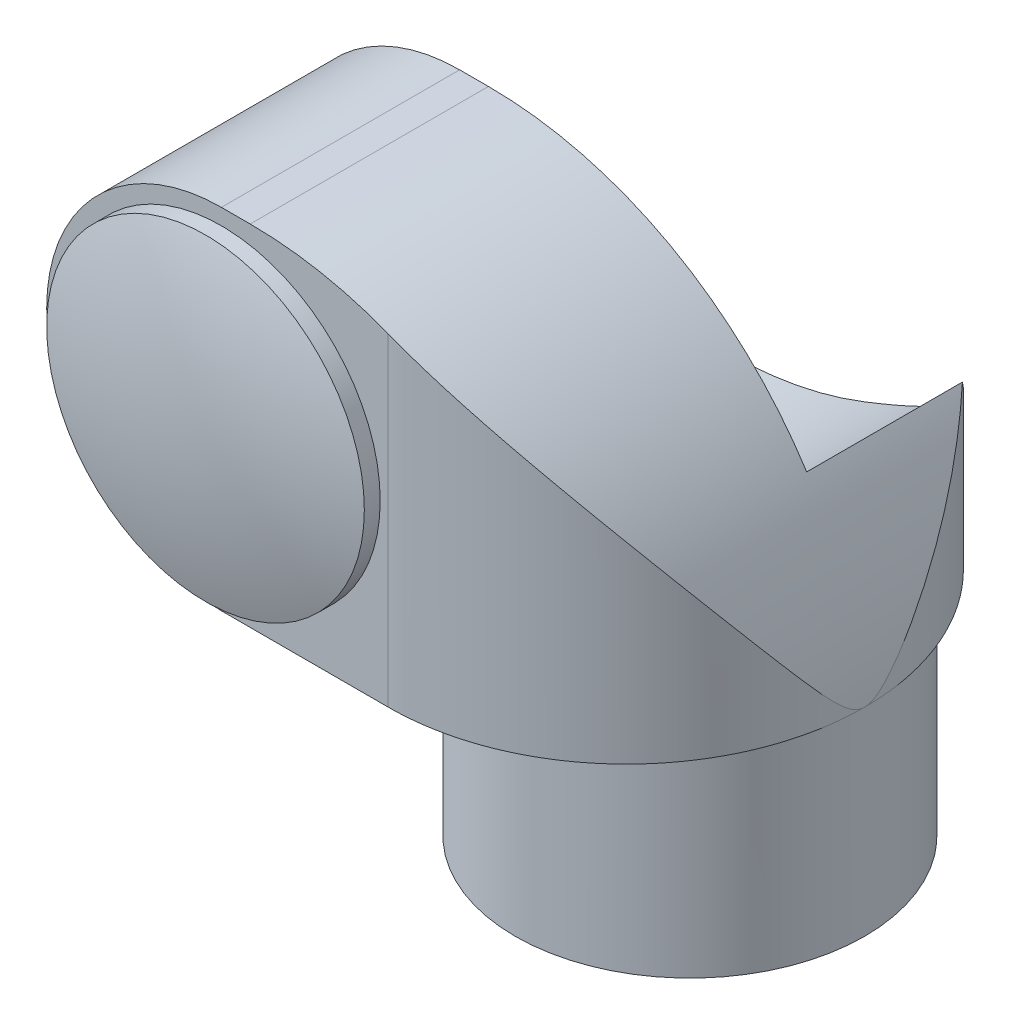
ISO-10303-21;
HEADER;
FILE_DESCRIPTION(('STEP AP214'),'2;1');
FILE_NAME('part.step','',(''),(''),'','','');
FILE_SCHEMA(('AUTOMOTIVE_DESIGN { 1 0 10303 214 1 1 1 1 }'));
ENDSEC;
DATA;
#1=APPLICATION_CONTEXT('core data for automotive mechanical design processes');
#2=APPLICATION_PROTOCOL_DEFINITION('international standard','automotive_design',2000,#1);
#3=PRODUCT_CONTEXT('',#1,'mechanical');
#4=PRODUCT('Part','Part','',(#3));
#5=PRODUCT_RELATED_PRODUCT_CATEGORY('part','',(#4));
#6=PRODUCT_DEFINITION_FORMATION('','',#4);
#7=PRODUCT_DEFINITION_CONTEXT('part definition',#1,'design');
#8=PRODUCT_DEFINITION('design','',#6,#7);
#9=PRODUCT_DEFINITION_SHAPE('','',#8);
#10=(LENGTH_UNIT() NAMED_UNIT(*) SI_UNIT(.MILLI.,.METRE.));
#11=(NAMED_UNIT(*) PLANE_ANGLE_UNIT() SI_UNIT($,.RADIAN.));
#12=(NAMED_UNIT(*) SI_UNIT($,.STERADIAN.) SOLID_ANGLE_UNIT());
#13=UNCERTAINTY_MEASURE_WITH_UNIT(LENGTH_MEASURE(1.E-05),#10,'distance_accuracy_value','');
#14=(GEOMETRIC_REPRESENTATION_CONTEXT(3) GLOBAL_UNCERTAINTY_ASSIGNED_CONTEXT((#13)) GLOBAL_UNIT_ASSIGNED_CONTEXT((#10,
#11,#12)) REPRESENTATION_CONTEXT('',''));
#15=CARTESIAN_POINT('',(0.,0.,0.));
#16=DIRECTION('',(0.,0.,1.));
#17=DIRECTION('',(1.,0.,0.));
#18=AXIS2_PLACEMENT_3D('',#15,#16,#17);
#19=CARTESIAN_POINT('',(-29.,0.,30.));
#20=DIRECTION('',(0.,0.,1.));
#21=DIRECTION('',(1.,0.,0.));
#22=AXIS2_PLACEMENT_3D('',#19,#20,#21);
#23=PLANE('',#22);
#24=DIRECTION('',(0.,1.,0.));
#25=VECTOR('',#24,1.);
#26=CARTESIAN_POINT('',(-8.,-22.,30.));
#27=LINE('',#26,#25);
#28=CARTESIAN_POINT('',(-8.,-22.,30.));
#29=VERTEX_POINT('',#28);
#30=CARTESIAN_POINT('',(-7.99999999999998,18.7097571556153,30.));
#31=VERTEX_POINT('',#30);
#32=EDGE_CURVE('E175',#29,#31,#27,.T.);
#33=ORIENTED_EDGE('',*,*,#32,.T.);
#34=CARTESIAN_POINT('',(-25.370877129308,-25.5,30.));
#35=DIRECTION('',(0.,0.,1.));
#36=DIRECTION('',(-1.,0.,0.));
#37=AXIS2_PLACEMENT_3D('',#34,#35,#36);
#38=CIRCLE('',#37,47.5);
#39=CARTESIAN_POINT('',(-25.370877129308,22.,30.));
#40=VERTEX_POINT('',#39);
#41=EDGE_CURVE('E191',#31,#40,#38,.T.);
#42=ORIENTED_EDGE('',*,*,#41,.T.);
#43=DIRECTION('',(-1.,0.,0.));
#44=VECTOR('',#43,1.);
#45=CARTESIAN_POINT('',(-29.,22.,30.));
#46=LINE('',#45,#44);
#47=CARTESIAN_POINT('',(-29.,22.,30.));
#48=VERTEX_POINT('',#47);
#49=EDGE_CURVE('E118',#40,#48,#46,.T.);
#50=ORIENTED_EDGE('',*,*,#49,.T.);
#51=CARTESIAN_POINT('',(-29.,0.,30.));
#52=DIRECTION('',(0.,0.,1.));
#53=DIRECTION('',(1.,0.,0.));
#54=AXIS2_PLACEMENT_3D('',#51,#52,#53);
#55=CIRCLE('',#54,22.);
#56=CARTESIAN_POINT('',(-29.,-22.,30.));
#57=VERTEX_POINT('',#56);
#58=EDGE_CURVE('E185',#48,#57,#55,.T.);
#59=ORIENTED_EDGE('',*,*,#58,.T.);
#60=DIRECTION('',(1.,0.,0.));
#61=VECTOR('',#60,1.);
#62=CARTESIAN_POINT('',(-29.,-22.,30.));
#63=LINE('',#62,#61);
#64=EDGE_CURVE('E188',#57,#29,#63,.T.);
#65=ORIENTED_EDGE('',*,*,#64,.T.);
#66=EDGE_LOOP('',(#33,#42,#50,#59,#65));
#67=FACE_BOUND('',#66,.T.);
#68=CARTESIAN_POINT('',(-29.,0.,30.));
#69=DIRECTION('',(0.,0.,1.));
#70=DIRECTION('',(1.,0.,0.));
#71=AXIS2_PLACEMENT_3D('',#68,#69,#70);
#72=CIRCLE('',#71,20.);
#73=CARTESIAN_POINT('',(-8.99999999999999,0.,30.));
#74=VERTEX_POINT('',#73);
#75=EDGE_CURVE('E218',#74,#74,#72,.T.);
#76=ORIENTED_EDGE('',*,*,#75,.F.);
#77=EDGE_LOOP('',(#76));
#78=FACE_BOUND('',#77,.T.);
#79=ADVANCED_FACE('F32',(#67,#78),#23,.T.);
#80=CARTESIAN_POINT('',(-29.,-22.,30.));
#81=DIRECTION('',(0.,1.,0.));
#82=DIRECTION('',(-1.,0.,0.));
#83=AXIS2_PLACEMENT_3D('',#80,#81,#82);
#84=PLANE('',#83);
#85=DIRECTION('',(0.,0.,1.));
#86=VECTOR('',#85,1.);
#87=CARTESIAN_POINT('',(-25.370877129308,-22.,-30.));
#88=LINE('',#87,#86);
#89=CARTESIAN_POINT('',(-25.370877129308,-22.,-30.));
#90=VERTEX_POINT('',#89);
#91=CARTESIAN_POINT('',(-25.370877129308,-22.,0.));
#92=VERTEX_POINT('',#91);
#93=EDGE_CURVE('E209',#90,#92,#88,.T.);
#94=ORIENTED_EDGE('',*,*,#93,.F.);
#95=DIRECTION('',(1.,0.,0.));
#96=VECTOR('',#95,1.);
#97=CARTESIAN_POINT('',(-29.,-22.,-30.));
#98=LINE('',#97,#96);
#99=CARTESIAN_POINT('',(-7.99999999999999,-22.,-30.));
#100=VERTEX_POINT('',#99);
#101=EDGE_CURVE('E55',#90,#100,#98,.T.);
#102=ORIENTED_EDGE('',*,*,#101,.T.);
#103=CARTESIAN_POINT('',(-8.,-22.,0.));
#104=DIRECTION('',(0.,-1.,0.));
#105=DIRECTION('',(1.,0.,0.));
#106=AXIS2_PLACEMENT_3D('',#103,#104,#105);
#107=CIRCLE('',#106,30.);
#108=CARTESIAN_POINT('',(22.,-22.,0.));
#109=VERTEX_POINT('',#108);
#110=EDGE_CURVE('E200',#100,#109,#107,.T.);
#111=ORIENTED_EDGE('',*,*,#110,.T.);
#112=CARTESIAN_POINT('',(0.,-22.,0.));
#113=DIRECTION('',(0.,1.,0.));
#114=DIRECTION('',(0.,0.,1.));
#115=AXIS2_PLACEMENT_3D('',#112,#113,#114);
#116=CIRCLE('',#115,22.);
#117=EDGE_CURVE('E181',#109,#109,#116,.T.);
#118=ORIENTED_EDGE('',*,*,#117,.T.);
#119=EDGE_CURVE('E198',#109,#29,#107,.T.);
#120=ORIENTED_EDGE('',*,*,#119,.T.);
#121=ORIENTED_EDGE('',*,*,#64,.F.);
#122=DIRECTION('',(0.,0.,-1.));
#123=VECTOR('',#122,1.);
#124=CARTESIAN_POINT('',(-29.,-22.,30.));
#125=LINE('',#124,#123);
#126=CARTESIAN_POINT('',(-29.,-22.,0.));
#127=VERTEX_POINT('',#126);
#128=EDGE_CURVE('E41',#57,#127,#125,.T.);
#129=ORIENTED_EDGE('',*,*,#128,.T.);
#130=DIRECTION('',(1.,0.,0.));
#131=VECTOR('',#130,1.);
#132=CARTESIAN_POINT('',(-29.,-22.,0.));
#133=LINE('',#132,#131);
#134=EDGE_CURVE('E196',#127,#92,#133,.T.);
#135=ORIENTED_EDGE('',*,*,#134,.T.);
#136=EDGE_LOOP('',(#94,#102,#111,#118,#120,#121,#129,#135));
#137=FACE_BOUND('',#136,.T.);
#138=ADVANCED_FACE('F149',(#137),#84,.F.);
#139=CARTESIAN_POINT('',(-29.,0.,30.));
#140=DIRECTION('',(0.,0.,-1.));
#141=DIRECTION('',(-1.,0.,0.));
#142=AXIS2_PLACEMENT_3D('',#139,#140,#141);
#143=CYLINDRICAL_SURFACE('',#142,22.);
#144=DIRECTION('',(0.,0.,-1.));
#145=VECTOR('',#144,1.);
#146=CARTESIAN_POINT('',(-29.,22.,30.));
#147=LINE('',#146,#145);
#148=CARTESIAN_POINT('',(-29.,22.,0.));
#149=VERTEX_POINT('',#148);
#150=EDGE_CURVE('E119',#48,#149,#147,.T.);
#151=ORIENTED_EDGE('',*,*,#150,.T.);
#152=CARTESIAN_POINT('',(-29.,0.,0.));
#153=DIRECTION('',(0.,0.,1.));
#154=DIRECTION('',(1.,0.,0.));
#155=AXIS2_PLACEMENT_3D('',#152,#153,#154);
#156=CIRCLE('',#155,22.);
#157=EDGE_CURVE('E101',#149,#127,#156,.T.);
#158=ORIENTED_EDGE('',*,*,#157,.T.);
#159=ORIENTED_EDGE('',*,*,#128,.F.);
#160=ORIENTED_EDGE('',*,*,#58,.F.);
#161=EDGE_LOOP('',(#151,#158,#159,#160));
#162=FACE_BOUND('',#161,.T.);
#163=ADVANCED_FACE('F155',(#162),#143,.T.);
#164=CARTESIAN_POINT('',(-25.370877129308,-25.5,30.));
#165=DIRECTION('',(0.,0.,-1.));
#166=DIRECTION('',(-1.,0.,0.));
#167=AXIS2_PLACEMENT_3D('',#164,#165,#166);
#168=CYLINDRICAL_SURFACE('',#167,47.5);
#169=CARTESIAN_POINT('',(-7.99999999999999,18.7097571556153,30.));
#170=CARTESIAN_POINT('',(-7.56651433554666,18.5394487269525,30.0000097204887));
#171=CARTESIAN_POINT('',(-7.1355781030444,18.362749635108,29.990605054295));
#172=CARTESIAN_POINT('',(-6.27980889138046,17.9970941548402,29.9537005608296));
#173=CARTESIAN_POINT('',(-5.85497483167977,17.8081399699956,29.9262039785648));
#174=CARTESIAN_POINT('',(-5.01290872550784,17.4187377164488,29.8539045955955));
#175=CARTESIAN_POINT('',(-4.59566595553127,17.2183078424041,29.8091285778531));
#176=CARTESIAN_POINT('',(-3.76890543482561,16.8062437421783,29.7030569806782));
#177=CARTESIAN_POINT('',(-3.35938802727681,16.5946090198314,29.6417606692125));
#178=CARTESIAN_POINT('',(-2.15202468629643,15.9483015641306,29.4357404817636));
#179=CARTESIAN_POINT('',(-1.36627834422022,15.4980098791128,29.268070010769));
#180=CARTESIAN_POINT('',(0.168412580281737,14.5600132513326,28.8774098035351));
#181=CARTESIAN_POINT('',(0.917338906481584,14.0722900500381,28.6543929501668));
#182=CARTESIAN_POINT('',(2.5531621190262,12.9410274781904,28.0988857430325));
#183=CARTESIAN_POINT('',(3.42927347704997,12.2884563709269,27.7529618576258));
#184=CARTESIAN_POINT('',(5.11749358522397,10.9400505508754,26.9960676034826));
#185=CARTESIAN_POINT('',(5.92959315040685,10.2442096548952,26.5850879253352));
#186=CARTESIAN_POINT('',(7.49285473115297,8.81259008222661,25.705633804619));
#187=CARTESIAN_POINT('',(8.24369978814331,8.07663296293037,25.2368883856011));
#188=CARTESIAN_POINT('',(9.68040760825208,6.57395304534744,24.2520491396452));
#189=CARTESIAN_POINT('',(10.3662666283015,5.80722847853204,23.7359525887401));
#190=CARTESIAN_POINT('',(11.9300216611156,3.94309939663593,22.453913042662));
#191=CARTESIAN_POINT('',(12.7782202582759,2.83356125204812,21.6691497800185));
#192=CARTESIAN_POINT('',(13.9610019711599,1.14071491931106,20.4459341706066));
#193=CARTESIAN_POINT('',(14.3404573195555,0.571477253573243,20.0303675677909));
#194=CARTESIAN_POINT('',(15.0701504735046,-0.575410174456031,19.1854034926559));
#195=CARTESIAN_POINT('',(15.420388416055,-1.15305989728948,18.7560060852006));
#196=CARTESIAN_POINT('',(16.4271284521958,-2.89526047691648,17.4505721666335));
#197=CARTESIAN_POINT('',(17.0409444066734,-4.0709185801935,16.5559483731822));
#198=CARTESIAN_POINT('',(17.8788126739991,-5.84946117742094,15.1846539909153));
#199=CARTESIAN_POINT('',(18.1442648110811,-6.44474259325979,14.722722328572));
#200=CARTESIAN_POINT('',(18.6481619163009,-7.63958107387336,13.7897254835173));
#201=CARTESIAN_POINT('',(18.8866076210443,-8.23913802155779,13.3186605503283));
#202=CARTESIAN_POINT('',(19.4348396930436,-9.70297471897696,12.1613875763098));
#203=CARTESIAN_POINT('',(19.7305689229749,-10.5690135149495,11.4706872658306));
#204=CARTESIAN_POINT('',(20.1339114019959,-11.8702367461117,10.4222411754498));
#205=CARTESIAN_POINT('',(20.2616448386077,-12.3043164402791,10.070711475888));
#206=CARTESIAN_POINT('',(20.5038360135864,-13.1726366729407,9.36328408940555));
#207=CARTESIAN_POINT('',(20.6182936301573,-13.606877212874,9.00738636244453));
#208=CARTESIAN_POINT('',(20.8756491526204,-14.642172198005,8.15267084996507));
#209=CARTESIAN_POINT('',(21.0124862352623,-15.2429587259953,7.65168036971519));
#210=CARTESIAN_POINT('',(21.1987780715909,-16.1399604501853,6.89195452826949));
#211=CARTESIAN_POINT('',(21.2576644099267,-16.4379635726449,6.63760221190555));
#212=CARTESIAN_POINT('',(21.3691969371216,-17.0320158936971,6.12527867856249));
#213=CARTESIAN_POINT('',(21.4218433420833,-17.3280651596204,5.86730758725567));
#214=CARTESIAN_POINT('',(21.5346196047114,-17.9986796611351,5.27454582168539));
#215=CARTESIAN_POINT('',(21.5927807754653,-18.3722699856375,4.93827638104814));
#216=CARTESIAN_POINT('',(21.6992110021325,-19.1127530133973,4.25192076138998));
#217=CARTESIAN_POINT('',(21.747413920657,-19.4795870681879,3.90175953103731));
#218=CARTESIAN_POINT('',(21.8119658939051,-20.0170583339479,3.35860630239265));
#219=CARTESIAN_POINT('',(21.832286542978,-20.1950858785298,3.17343622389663));
#220=CARTESIAN_POINT('',(21.8701342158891,-20.5434422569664,2.794893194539));
#221=CARTESIAN_POINT('',(21.8876555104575,-20.7137548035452,2.60150442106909));
#222=CARTESIAN_POINT('',(21.9194864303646,-21.0392872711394,2.20534221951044));
#223=CARTESIAN_POINT('',(21.9338268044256,-21.1946426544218,2.00268376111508));
#224=CARTESIAN_POINT('',(21.9590429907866,-21.4814199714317,1.5811895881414));
#225=CARTESIAN_POINT('',(21.9699344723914,-21.6129489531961,1.36243277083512));
#226=CARTESIAN_POINT('',(21.9837749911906,-21.7863358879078,0.995881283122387));
#227=CARTESIAN_POINT('',(21.9881533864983,-21.8429202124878,0.85533096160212));
#228=CARTESIAN_POINT('',(21.9949833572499,-21.9324673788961,0.567099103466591));
#229=CARTESIAN_POINT('',(21.9974427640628,-21.9655261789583,0.419449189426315));
#230=CARTESIAN_POINT('',(22.0001466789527,-22.0019239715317,0.118381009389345));
#231=CARTESIAN_POINT('',(22.0003631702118,-22.0048870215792,-0.0350862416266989));
#232=CARTESIAN_POINT('',(21.9984675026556,-21.9793046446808,-0.339504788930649));
#233=CARTESIAN_POINT('',(21.9963500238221,-21.9506872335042,-0.490449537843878));
#234=CARTESIAN_POINT('',(21.9893426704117,-21.8582881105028,-0.820270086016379));
#235=CARTESIAN_POINT('',(21.9839083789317,-21.787703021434,-0.997129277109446));
#236=CARTESIAN_POINT('',(21.9706034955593,-21.6216987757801,-1.33878747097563));
#237=CARTESIAN_POINT('',(21.9627231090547,-21.5261800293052,-1.50353463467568));
#238=CARTESIAN_POINT('',(21.9384457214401,-21.2444524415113,-1.9409122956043));
#239=CARTESIAN_POINT('',(21.9200528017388,-21.0432950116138,-2.20354789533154));
#240=CARTESIAN_POINT('',(21.8782979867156,-20.6202954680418,-2.7114537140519));
#241=CARTESIAN_POINT('',(21.8549210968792,-20.3983920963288,-2.95666848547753));
#242=CARTESIAN_POINT('',(21.8034022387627,-19.942088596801,-3.43742704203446));
#243=CARTESIAN_POINT('',(21.7752327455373,-19.7076219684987,-3.67290460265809));
#244=CARTESIAN_POINT('',(21.7144260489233,-19.2324943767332,-4.13609641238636));
#245=CARTESIAN_POINT('',(21.681795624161,-18.9918432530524,-4.36382179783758));
#246=CARTESIAN_POINT('',(21.6124179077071,-18.5086468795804,-4.81202947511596));
#247=CARTESIAN_POINT('',(21.5757114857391,-18.2661397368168,-5.03255927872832));
#248=CARTESIAN_POINT('',(21.4979657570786,-17.7784327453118,-5.46985268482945));
#249=CARTESIAN_POINT('',(21.4569262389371,-17.5332327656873,-5.68661610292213));
#250=CARTESIAN_POINT('',(21.327307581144,-16.7948813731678,-6.33263325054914));
#251=CARTESIAN_POINT('',(21.23223937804,-16.2990559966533,-6.75754322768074));
#252=CARTESIAN_POINT('',(21.0246500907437,-15.3037208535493,-7.59985308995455));
#253=CARTESIAN_POINT('',(20.912108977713,-14.8042074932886,-8.01724373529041));
#254=CARTESIAN_POINT('',(20.6695491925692,-13.8041083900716,-8.84551530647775));
#255=CARTESIAN_POINT('',(20.5395321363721,-13.3035227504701,-9.25639683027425));
#256=CARTESIAN_POINT('',(20.2622292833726,-12.3038653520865,-10.0713009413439));
#257=CARTESIAN_POINT('',(20.1149904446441,-11.8047931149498,-10.475338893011));
#258=CARTESIAN_POINT('',(19.8027933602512,-10.8077420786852,-11.2778552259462));
#259=CARTESIAN_POINT('',(19.6378348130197,-10.3097632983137,-11.6763335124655));
#260=CARTESIAN_POINT('',(19.1161909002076,-8.81890038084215,-12.8630936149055));
#261=CARTESIAN_POINT('',(18.7326056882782,-7.82861250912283,-13.6430884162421));
#262=CARTESIAN_POINT('',(18.0501654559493,-6.23063019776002,-14.8891363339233));
#263=CARTESIAN_POINT('',(17.7737582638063,-5.61921982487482,-15.3628563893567));
#264=CARTESIAN_POINT('',(17.1918194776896,-4.40208764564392,-16.2995801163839));
#265=CARTESIAN_POINT('',(16.8862869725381,-3.79636601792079,-16.7625834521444));
#266=CARTESIAN_POINT('',(15.9248222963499,-1.98875820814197,-18.1342348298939));
#267=CARTESIAN_POINT('',(15.22413502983,-0.796693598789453,-19.025317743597));
#268=CARTESIAN_POINT('',(14.080666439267,0.963467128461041,-20.3168513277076));
#269=CARTESIAN_POINT('',(13.6841269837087,1.54550179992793,-20.7398265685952));
#270=CARTESIAN_POINT('',(12.8595257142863,2.69909858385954,-21.569009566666));
#271=CARTESIAN_POINT('',(12.4314626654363,3.27066028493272,-21.9752166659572));
#272=CARTESIAN_POINT('',(11.0995658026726,4.9667297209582,-23.1651360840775));
#273=CARTESIAN_POINT('',(10.1472862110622,6.07376735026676,-23.9209907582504));
#274=CARTESIAN_POINT('',(8.51158018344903,7.80220969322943,-25.0586057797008));
#275=CARTESIAN_POINT('',(7.8696604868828,8.44341721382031,-25.4706040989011));
#276=CARTESIAN_POINT('',(6.53680472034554,9.69925774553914,-26.2541179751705));
#277=CARTESIAN_POINT('',(5.84587424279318,10.3138937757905,-26.6256381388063));
#278=CARTESIAN_POINT('',(4.41787795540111,11.5100596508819,-27.3207734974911));
#279=CARTESIAN_POINT('',(3.68098884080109,12.0917016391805,-27.6445577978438));
#280=CARTESIAN_POINT('',(2.15994560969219,13.2194989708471,-28.2390138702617));
#281=CARTESIAN_POINT('',(1.37579569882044,13.7656574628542,-28.509690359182));
#282=CARTESIAN_POINT('',(-0.0893003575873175,14.7207704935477,-28.9463868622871));
#283=CARTESIAN_POINT('',(-0.762822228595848,15.1365259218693,-29.1224958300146));
#284=CARTESIAN_POINT('',(-2.13742470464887,15.9377707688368,-29.4300145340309));
#285=CARTESIAN_POINT('',(-2.83849538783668,16.3232709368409,-29.561440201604));
#286=CARTESIAN_POINT('',(-3.91114854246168,16.8779901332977,-29.7222730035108));
#287=CARTESIAN_POINT('',(-4.27368781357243,17.0596477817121,-29.7699489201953));
#288=CARTESIAN_POINT('',(-5.00450980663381,17.4141696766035,-29.8523403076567));
#289=CARTESIAN_POINT('',(-5.37279235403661,17.5870341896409,-29.887056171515));
#290=CARTESIAN_POINT('',(-6.11493402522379,17.9237818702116,-29.9430314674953));
#291=CARTESIAN_POINT('',(-6.48879872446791,18.0876551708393,-29.964276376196));
#292=CARTESIAN_POINT('',(-7.24112326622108,18.4059118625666,-29.9927644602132));
#293=CARTESIAN_POINT('',(-7.61958365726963,18.5602941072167,-30.0000059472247));
#294=CARTESIAN_POINT('',(-7.99999999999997,18.7097571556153,-30.));
#295=B_SPLINE_CURVE_WITH_KNOTS('',3,(#169,#170,#171,#172,#173,#174,#175,#176,#177,#178,#179,
#180,#181,#182,#183,#184,#185,#186,#187,#188,#189,#190,#191,#192,#193,#194,#195,#196,#197,#198,
#199,#200,#201,#202,#203,#204,#205,#206,#207,#208,#209,#210,#211,#212,#213,#214,#215,#216,#217,
#218,#219,#220,#221,#222,#223,#224,#225,#226,#227,#228,#229,#230,#231,#232,#233,#234,#235,#236,
#237,#238,#239,#240,#241,#242,#243,#244,#245,#246,#247,#248,#249,#250,#251,#252,#253,#254,#255,
#256,#257,#258,#259,#260,#261,#262,#263,#264,#265,#266,#267,#268,#269,#270,#271,#272,#273,#274,
#275,#276,#277,#278,#279,#280,#281,#282,#283,#284,#285,#286,#287,#288,#289,#290,#291,#292,#293,
#294),.UNSPECIFIED.,.F.,.F.,(4,2,2,2,2,2,2,2,2,2,2,2,2,2,2,2,2,2,2,2,2,2,2,2,2,2,2,2,2,2,2,2,2,
2,2,2,2,2,2,2,2,2,2,2,2,2,2,2,2,2,2,2,2,2,2,2,2,2,2,2,2,2,4),(0.,1.39702311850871,
2.79379573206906,4.18841200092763,5.58309007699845,8.34239851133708,11.1030615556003,
14.5356517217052,17.9687335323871,21.4185809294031,24.8686269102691,29.6669298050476,
32.0677195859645,34.4684981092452,39.2621903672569,41.6584374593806,44.0546191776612,
47.4926192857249,49.2114437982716,50.9302840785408,53.3121675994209,54.5006931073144,
55.6891774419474,57.2069868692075,58.7345738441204,59.5074392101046,60.2818666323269,
61.048445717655,61.8114903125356,62.2647675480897,62.7161851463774,63.1732348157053,
63.6313284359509,64.1996278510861,64.7702328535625,65.7614555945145,66.7557036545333,
67.7558675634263,68.7545282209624,69.7439519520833,70.7334239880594,72.712684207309,
74.6942301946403,76.6755930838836,78.6516741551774,80.627788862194,84.5781346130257,
87.0416653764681,89.5052732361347,94.4335475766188,96.897428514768,99.3614060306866,
104.284569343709,107.272032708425,110.259155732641,113.235428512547,116.211436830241,
118.64202426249,121.071744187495,122.296357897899,123.520934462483,124.746829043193,
125.972871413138),.UNSPECIFIED.);
#296=CARTESIAN_POINT('',(14.7040526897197,0.,-19.609334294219));
#297=VERTEX_POINT('',#296);
#298=EDGE_CURVE('E168',#109,#297,#295,.T.);
#299=ORIENTED_EDGE('',*,*,#298,.T.);
#300=DIRECTION('',(0.,0.,1.));
#301=VECTOR('',#300,1.);
#302=CARTESIAN_POINT('',(14.7040526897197,0.,-30.));
#303=LINE('',#302,#301);
#304=CARTESIAN_POINT('',(14.7040526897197,0.,0.));
#305=VERTEX_POINT('',#304);
#306=EDGE_CURVE('E48',#297,#305,#303,.T.);
#307=ORIENTED_EDGE('',*,*,#306,.T.);
#308=CARTESIAN_POINT('',(-25.370877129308,-25.5,0.));
#309=DIRECTION('',(0.,0.,1.));
#310=DIRECTION('',(1.,0.,0.));
#311=AXIS2_PLACEMENT_3D('',#308,#309,#310);
#312=CIRCLE('',#311,47.5);
#313=CARTESIAN_POINT('',(-25.370877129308,22.,0.));
#314=VERTEX_POINT('',#313);
#315=EDGE_CURVE('E99',#305,#314,#312,.T.);
#316=ORIENTED_EDGE('',*,*,#315,.T.);
#317=DIRECTION('',(0.,0.,-1.));
#318=VECTOR('',#317,1.);
#319=CARTESIAN_POINT('',(-25.370877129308,22.,30.));
#320=LINE('',#319,#318);
#321=EDGE_CURVE('E112',#40,#314,#320,.T.);
#322=ORIENTED_EDGE('',*,*,#321,.F.);
#323=ORIENTED_EDGE('',*,*,#41,.F.);
#324=EDGE_CURVE('E174',#31,#109,#295,.T.);
#325=ORIENTED_EDGE('',*,*,#324,.T.);
#326=EDGE_LOOP('',(#299,#307,#316,#322,#323,#325));
#327=FACE_BOUND('',#326,.T.);
#328=ADVANCED_FACE('F110',(#327),#168,.T.);
#329=CARTESIAN_POINT('',(-29.,22.,30.));
#330=DIRECTION('',(0.,-1.,0.));
#331=DIRECTION('',(0.,0.,-1.));
#332=AXIS2_PLACEMENT_3D('',#329,#330,#331);
#333=PLANE('',#332);
#334=ORIENTED_EDGE('',*,*,#321,.T.);
#335=DIRECTION('',(-1.,0.,0.));
#336=VECTOR('',#335,1.);
#337=CARTESIAN_POINT('',(-25.370877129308,22.,0.));
#338=LINE('',#337,#336);
#339=EDGE_CURVE('E96',#314,#149,#338,.T.);
#340=ORIENTED_EDGE('',*,*,#339,.T.);
#341=ORIENTED_EDGE('',*,*,#150,.F.);
#342=ORIENTED_EDGE('',*,*,#49,.F.);
#343=EDGE_LOOP('',(#334,#340,#341,#342));
#344=FACE_BOUND('',#343,.T.);
#345=ADVANCED_FACE('F117',(#344),#333,.F.);
#346=CARTESIAN_POINT('',(-29.,0.,-30.));
#347=DIRECTION('',(0.,0.,1.));
#348=DIRECTION('',(1.,0.,0.));
#349=AXIS2_PLACEMENT_3D('',#346,#347,#348);
#350=PLANE('',#349);
#351=ORIENTED_EDGE('',*,*,#101,.F.);
#352=CARTESIAN_POINT('',(-25.370877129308,25.5,-30.));
#353=DIRECTION('',(0.,0.,1.));
#354=DIRECTION('',(-1.,0.,0.));
#355=AXIS2_PLACEMENT_3D('',#352,#353,#354);
#356=CIRCLE('',#355,47.5);
#357=CARTESIAN_POINT('',(-8.,-18.7097571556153,-30.));
#358=VERTEX_POINT('',#357);
#359=EDGE_CURVE('E114',#90,#358,#356,.T.);
#360=ORIENTED_EDGE('',*,*,#359,.T.);
#361=DIRECTION('',(0.,1.,0.));
#362=VECTOR('',#361,1.);
#363=CARTESIAN_POINT('',(-8.00000000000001,-22.,-30.));
#364=LINE('',#363,#362);
#365=EDGE_CURVE('E176',#100,#358,#364,.T.);
#366=ORIENTED_EDGE('',*,*,#365,.F.);
#367=EDGE_LOOP('',(#351,#360,#366));
#368=FACE_BOUND('',#367,.T.);
#369=ADVANCED_FACE('F161',(#368),#350,.F.);
#370=CARTESIAN_POINT('',(0.,22.74636757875,0.));
#371=DIRECTION('',(0.,1.,0.));
#372=DIRECTION('',(0.,0.,1.));
#373=AXIS2_PLACEMENT_3D('',#370,#371,#372);
#374=CYLINDRICAL_SURFACE('',#373,22.);
#375=ORIENTED_EDGE('',*,*,#117,.F.);
#376=EDGE_LOOP('',(#375));
#377=FACE_BOUND('',#376,.T.);
#378=CARTESIAN_POINT('',(0.,-47.,0.));
#379=DIRECTION('',(0.,1.,0.));
#380=DIRECTION('',(0.,0.,1.));
#381=AXIS2_PLACEMENT_3D('',#378,#379,#380);
#382=CIRCLE('',#381,22.);
#383=CARTESIAN_POINT('',(0.,-47.,22.));
#384=VERTEX_POINT('',#383);
#385=EDGE_CURVE('E178',#384,#384,#382,.T.);
#386=ORIENTED_EDGE('',*,*,#385,.T.);
#387=EDGE_LOOP('',(#386));
#388=FACE_BOUND('',#387,.T.);
#389=ADVANCED_FACE('F230',(#377,#388),#374,.T.);
#390=CARTESIAN_POINT('',(22.,-47.,0.));
#391=DIRECTION('',(0.,1.,0.));
#392=DIRECTION('',(0.,0.,1.));
#393=AXIS2_PLACEMENT_3D('',#390,#391,#392);
#394=PLANE('',#393);
#395=ORIENTED_EDGE('',*,*,#385,.F.);
#396=EDGE_LOOP('',(#395));
#397=FACE_BOUND('',#396,.T.);
#398=ADVANCED_FACE('F225',(#397),#394,.F.);
#399=CARTESIAN_POINT('',(-8.,-22.,0.));
#400=DIRECTION('',(0.,1.,0.));
#401=DIRECTION('',(-1.,0.,0.));
#402=AXIS2_PLACEMENT_3D('',#399,#400,#401);
#403=CYLINDRICAL_SURFACE('',#402,30.);
#404=ORIENTED_EDGE('',*,*,#365,.T.);
#405=CARTESIAN_POINT('',(-7.99999999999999,-18.7097571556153,-30.));
#406=CARTESIAN_POINT('',(-7.56658807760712,-18.5394776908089,-30.0000097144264));
#407=CARTESIAN_POINT('',(-7.13572470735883,-18.3628097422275,-29.9906082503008));
#408=CARTESIAN_POINT('',(-6.28009896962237,-17.9972206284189,-29.9537161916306));
#409=CARTESIAN_POINT('',(-5.85533552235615,-17.8083016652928,-29.9262288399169));
#410=CARTESIAN_POINT('',(-5.01339853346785,-17.4189693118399,-29.8539527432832));
#411=CARTESIAN_POINT('',(-4.59621442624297,-17.2185738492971,-29.8091903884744));
#412=CARTESIAN_POINT('',(-3.76956857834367,-16.8065816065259,-29.7031506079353));
#413=CARTESIAN_POINT('',(-3.36010718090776,-16.5949843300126,-29.6418724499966));
#414=CARTESIAN_POINT('',(-2.1526499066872,-15.9486553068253,-29.4358687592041));
#415=CARTESIAN_POINT('',(-1.36675984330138,-15.4982952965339,-29.2681829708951));
#416=CARTESIAN_POINT('',(0.168189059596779,-14.5601587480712,-28.8774763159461));
#417=CARTESIAN_POINT('',(0.917230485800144,-14.0723647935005,-28.6544295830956));
#418=CARTESIAN_POINT('',(2.55322538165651,-12.9409840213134,-28.0988644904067));
#419=CARTESIAN_POINT('',(3.42939449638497,-12.288367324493,-27.7529149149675));
#420=CARTESIAN_POINT('',(5.11779458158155,-10.9398025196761,-26.9959253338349));
#421=CARTESIAN_POINT('',(5.93001137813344,-10.2438448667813,-26.584870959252));
#422=CARTESIAN_POINT('',(7.4933750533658,-8.81209525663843,-25.7053226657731));
#423=CARTESIAN_POINT('',(8.24421177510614,-8.07612894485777,-25.2365638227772));
#424=CARTESIAN_POINT('',(9.68079322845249,-6.57351821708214,-24.2517583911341));
#425=CARTESIAN_POINT('',(10.3665535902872,-5.80688123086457,-23.7357232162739));
#426=CARTESIAN_POINT('',(11.3627329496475,-4.61935852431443,-22.9189997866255));
#427=CARTESIAN_POINT('',(11.6963563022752,-4.20770924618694,-22.6328084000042));
#428=CARTESIAN_POINT('',(12.3463032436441,-3.37805226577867,-22.050358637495));
#429=CARTESIAN_POINT('',(12.6626300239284,-2.96004575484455,-21.7541021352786));
#430=CARTESIAN_POINT('',(13.2759812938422,-2.12133751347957,-21.1545553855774));
#431=CARTESIAN_POINT('',(13.5731311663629,-1.70067853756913,-20.8513333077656));
#432=CARTESIAN_POINT('',(14.1509226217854,-0.854124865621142,-20.2364643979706));
#433=CARTESIAN_POINT('',(14.4315625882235,-0.428229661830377,-19.9248167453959));
#434=CARTESIAN_POINT('',(14.7040526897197,0.,-19.609334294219));
#435=B_SPLINE_CURVE_WITH_KNOTS('',3,(#405,#406,#407,#408,#409,#410,#411,#412,#413,#414,#415,
#416,#417,#418,#419,#420,#421,#422,#423,#424,#425,#426,#427,#428,#429,#430,#431,#432,#433,#434),
.UNSPECIFIED.,.F.,.F.,(4,2,2,2,2,2,2,2,2,2,2,2,2,2,4),(0.,1.39678554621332,2.79332071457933,
4.18773086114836,5.58220283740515,8.34198597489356,11.1030609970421,14.5358925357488,
17.9694827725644,21.4194698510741,24.868626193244,26.6749744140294,28.4809881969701,
30.2736537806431,32.0664945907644),.UNSPECIFIED.);
#436=EDGE_CURVE('E11',#358,#297,#435,.T.);
#437=ORIENTED_EDGE('',*,*,#436,.T.);
#438=ORIENTED_EDGE('',*,*,#298,.F.);
#439=ORIENTED_EDGE('',*,*,#110,.F.);
#440=EDGE_LOOP('',(#404,#437,#438,#439));
#441=FACE_BOUND('',#440,.T.);
#442=ADVANCED_FACE('F223',(#441),#403,.T.);
#443=ORIENTED_EDGE('',*,*,#324,.F.);
#444=ORIENTED_EDGE('',*,*,#32,.F.);
#445=ORIENTED_EDGE('',*,*,#119,.F.);
#446=EDGE_LOOP('',(#443,#444,#445));
#447=FACE_BOUND('',#446,.T.);
#448=ADVANCED_FACE('F130',(#447),#403,.T.);
#449=CARTESIAN_POINT('',(-25.370877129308,25.5,-30.));
#450=DIRECTION('',(0.,0.,1.));
#451=DIRECTION('',(1.,0.,0.));
#452=AXIS2_PLACEMENT_3D('',#449,#450,#451);
#453=CYLINDRICAL_SURFACE('',#452,47.5);
#454=ORIENTED_EDGE('',*,*,#359,.F.);
#455=ORIENTED_EDGE('',*,*,#93,.T.);
#456=CARTESIAN_POINT('',(-25.370877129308,25.5,0.));
#457=DIRECTION('',(0.,0.,1.));
#458=DIRECTION('',(-1.,0.,0.));
#459=AXIS2_PLACEMENT_3D('',#456,#457,#458);
#460=CIRCLE('',#459,47.5);
#461=EDGE_CURVE('E115',#92,#305,#460,.T.);
#462=ORIENTED_EDGE('',*,*,#461,.T.);
#463=ORIENTED_EDGE('',*,*,#306,.F.);
#464=ORIENTED_EDGE('',*,*,#436,.F.);
#465=EDGE_LOOP('',(#454,#455,#462,#463,#464));
#466=FACE_BOUND('',#465,.T.);
#467=ADVANCED_FACE('F133',(#466),#453,.F.);
#468=CARTESIAN_POINT('',(-25.370877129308,-25.5,0.));
#469=DIRECTION('',(0.,0.,1.));
#470=DIRECTION('',(1.,0.,0.));
#471=AXIS2_PLACEMENT_3D('',#468,#469,#470);
#472=PLANE('',#471);
#473=ORIENTED_EDGE('',*,*,#315,.F.);
#474=ORIENTED_EDGE('',*,*,#461,.F.);
#475=ORIENTED_EDGE('',*,*,#134,.F.);
#476=ORIENTED_EDGE('',*,*,#157,.F.);
#477=ORIENTED_EDGE('',*,*,#339,.F.);
#478=EDGE_LOOP('',(#473,#474,#475,#476,#477));
#479=FACE_BOUND('',#478,.T.);
#480=ADVANCED_FACE('F98',(#479),#472,.F.);
#481=CARTESIAN_POINT('',(-29.,0.,32.));
#482=DIRECTION('',(0.,0.,-1.));
#483=DIRECTION('',(-1.,0.,0.));
#484=AXIS2_PLACEMENT_3D('',#481,#482,#483);
#485=CYLINDRICAL_SURFACE('',#484,20.);
#486=CARTESIAN_POINT('',(-29.,0.,32.));
#487=DIRECTION('',(0.,0.,1.));
#488=DIRECTION('',(1.,0.,0.));
#489=AXIS2_PLACEMENT_3D('',#486,#487,#488);
#490=CIRCLE('',#489,20.);
#491=CARTESIAN_POINT('',(-8.99999999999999,0.,32.));
#492=VERTEX_POINT('',#491);
#493=EDGE_CURVE('E36',#492,#492,#490,.T.);
#494=ORIENTED_EDGE('',*,*,#493,.F.);
#495=EDGE_LOOP('',(#494));
#496=FACE_BOUND('',#495,.T.);
#497=ORIENTED_EDGE('',*,*,#75,.T.);
#498=EDGE_LOOP('',(#497));
#499=FACE_BOUND('',#498,.T.);
#500=ADVANCED_FACE('F139',(#496,#499),#485,.T.);
#501=CARTESIAN_POINT('',(-29.,0.,-33.1666666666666));
#502=DIRECTION('',(0.,0.,1.));
#503=DIRECTION('',(1.,0.,0.));
#504=AXIS2_PLACEMENT_3D('',#501,#502,#503);
#505=SPHERICAL_SURFACE('',#504,68.1666666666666);
#506=ORIENTED_EDGE('',*,*,#493,.T.);
#507=EDGE_LOOP('',(#506));
#508=FACE_BOUND('',#507,.T.);
#509=ADVANCED_FACE('F34',(#508),#505,.T.);
#510=CLOSED_SHELL('',(#79,#138,#163,#328,#345,#369,#389,#398,#442,#448,#467,#480,#500,#509));
#511=MANIFOLD_SOLID_BREP('B2',#510);
#512=ADVANCED_BREP_SHAPE_REPRESENTATION('',(#18,#511),#14);
#513=SHAPE_DEFINITION_REPRESENTATION(#9,#512);
ENDSEC;
END-ISO-10303-21;
